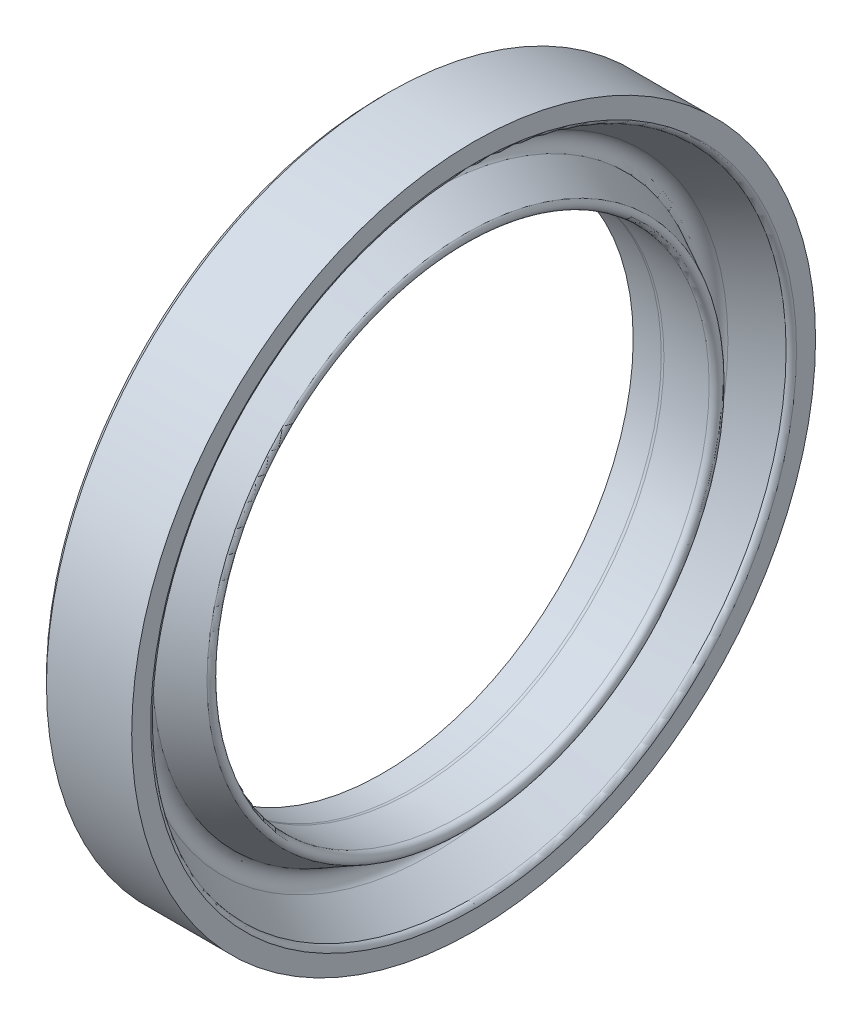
from build123d import *


with BuildPart() as part:
    # Esquisse2 → R_volution2 (revolve)
    with BuildSketch(Plane.XY, mode=Mode.PRIVATE) as r_volution2_sk:
        with BuildLine():
            Line((-9.1, -37.5), (-9.75, -36.85))
            Line((-9.75, -36.85), (-9.75, -27.5))
            Line((-9.75, -27.5), (-6.671148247, -27.5))
            ThreePointArc((-6.671148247, -27.5), (-6.501464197, -27.48887832), (-6.334683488, -27.455703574))
            Line((-6.334683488, -27.455703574), (-1.196815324, -27.278716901))
            ThreePointArc((-1.196815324, -27.278716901), (-0.484142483, -27.592300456), (-0.636042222, -28.355952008))
            Line((-0.636042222, -28.355952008), (-4.559729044, -30.389681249))
            ThreePointArc((-4.559729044, -30.389681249), (-5.019158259, -31.498841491), (-4.374105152, -32.51137205))
            Line((-4.374105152, -32.51137205), (-0.325, -34.849124))
            ThreePointArc((-0.325, -34.849124), (0.060078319, -35.030909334), (0.25, -35.412040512))
            Line((0.25, -35.412040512), (0.25, -37.5))
            Line((0.25, -37.5), (-9.1, -37.5))
        make_face()
    revolve(r_volution2_sk.sketch.rotate(Axis((2.43404063, 0, 0), (-1, 0, 0)), 270), axis=Axis((2.43404063, 0, 0), (-1, 0, 0)))


solid = part.part
